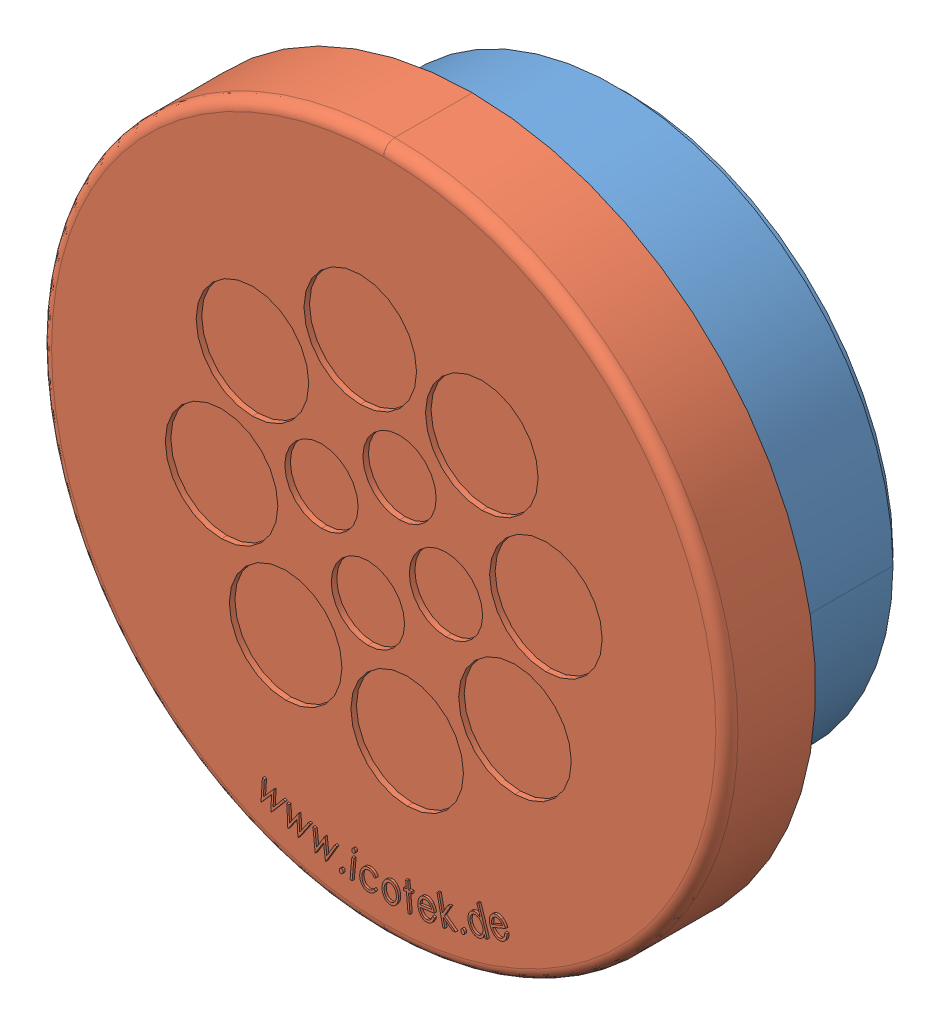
SolidWorks assembly 43752.SLDASM, configuration Default (file format 8000). Lengths in mm.
Overall size (62 62 22.2).
2 component instances, 2 part files, 0 mates.
Components (placement in the parent):
- 43752_01-1: 43752_01.SLDPRT [Default] at origin size (50 50 14)
- 43752_02-1: 43752_02.SLDPRT [Default] at origin size (62 62 8.2)
